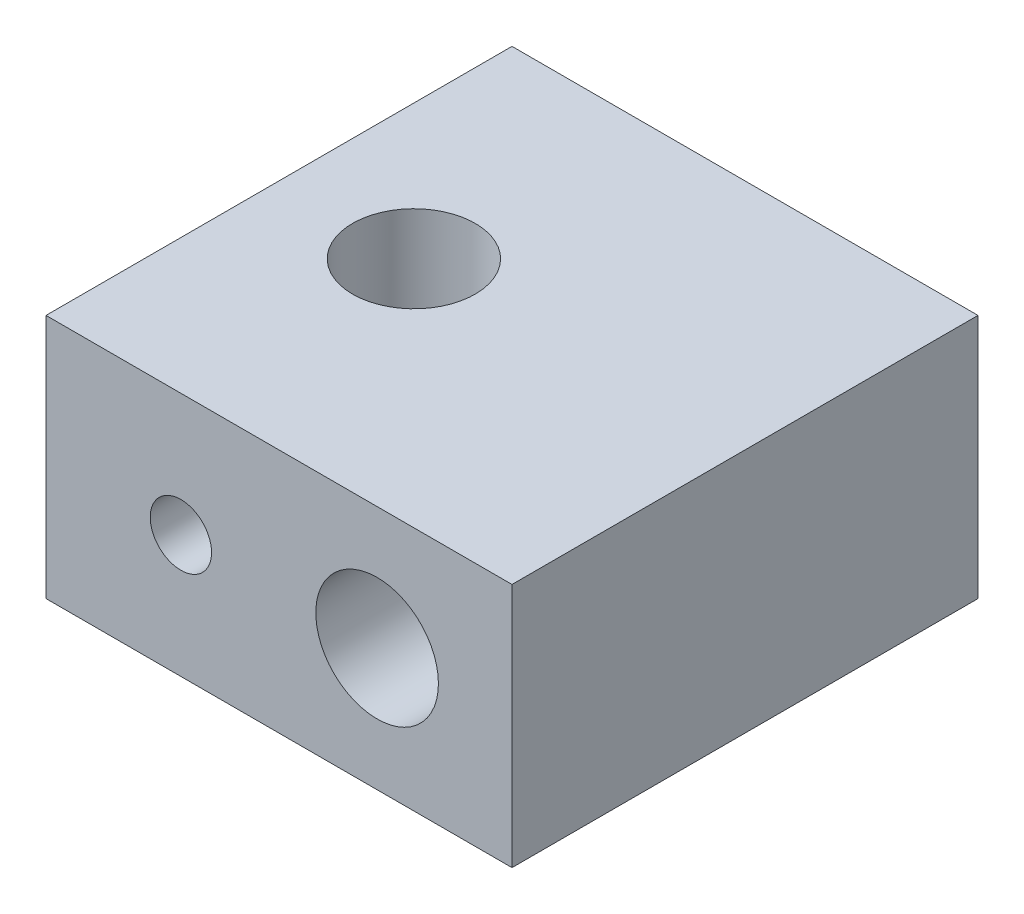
ISO-10303-21;
HEADER;
FILE_DESCRIPTION(('STEP AP214'),'2;1');
FILE_NAME('part.step','',(''),(''),'','','');
FILE_SCHEMA(('AUTOMOTIVE_DESIGN { 1 0 10303 214 1 1 1 1 }'));
ENDSEC;
DATA;
#1=APPLICATION_CONTEXT('core data for automotive mechanical design processes');
#2=APPLICATION_PROTOCOL_DEFINITION('international standard','automotive_design',2000,#1);
#3=PRODUCT_CONTEXT('',#1,'mechanical');
#4=PRODUCT('Part','Part','',(#3));
#5=PRODUCT_RELATED_PRODUCT_CATEGORY('part','',(#4));
#6=PRODUCT_DEFINITION_FORMATION('','',#4);
#7=PRODUCT_DEFINITION_CONTEXT('part definition',#1,'design');
#8=PRODUCT_DEFINITION('design','',#6,#7);
#9=PRODUCT_DEFINITION_SHAPE('','',#8);
#10=(LENGTH_UNIT() NAMED_UNIT(*) SI_UNIT(.MILLI.,.METRE.));
#11=(NAMED_UNIT(*) PLANE_ANGLE_UNIT() SI_UNIT($,.RADIAN.));
#12=(NAMED_UNIT(*) SI_UNIT($,.STERADIAN.) SOLID_ANGLE_UNIT());
#13=UNCERTAINTY_MEASURE_WITH_UNIT(LENGTH_MEASURE(1.E-05),#10,'distance_accuracy_value','');
#14=(GEOMETRIC_REPRESENTATION_CONTEXT(3) GLOBAL_UNCERTAINTY_ASSIGNED_CONTEXT((#13)) GLOBAL_UNIT_ASSIGNED_CONTEXT((#10,
#11,#12)) REPRESENTATION_CONTEXT('',''));
#15=CARTESIAN_POINT('',(0.,0.,0.));
#16=DIRECTION('',(0.,0.,1.));
#17=DIRECTION('',(1.,0.,0.));
#18=AXIS2_PLACEMENT_3D('',#15,#16,#17);
#19=CARTESIAN_POINT('',(-4.,0.,0.));
#20=DIRECTION('',(0.,1.,0.));
#21=DIRECTION('',(0.,0.,1.));
#22=AXIS2_PLACEMENT_3D('',#19,#20,#21);
#23=CYLINDRICAL_SURFACE('',#22,2.5);
#24=CARTESIAN_POINT('',(-4.,10.,0.));
#25=DIRECTION('',(0.,1.,0.));
#26=DIRECTION('',(0.,0.,1.));
#27=AXIS2_PLACEMENT_3D('',#24,#25,#26);
#28=CIRCLE('',#27,2.5);
#29=CARTESIAN_POINT('',(-4.,10.,2.5));
#30=VERTEX_POINT('',#29);
#31=EDGE_CURVE('E108',#30,#30,#28,.T.);
#32=ORIENTED_EDGE('',*,*,#31,.T.);
#33=EDGE_LOOP('',(#32));
#34=FACE_BOUND('',#33,.T.);
#35=CARTESIAN_POINT('',(-4.,1.5,0.));
#36=DIRECTION('',(0.,-1.,0.));
#37=DIRECTION('',(0.,0.,-1.));
#38=AXIS2_PLACEMENT_3D('',#35,#36,#37);
#39=CIRCLE('',#38,2.5);
#40=CARTESIAN_POINT('',(-4.,1.5,-2.5));
#41=VERTEX_POINT('',#40);
#42=EDGE_CURVE('E113',#41,#41,#39,.F.);
#43=ORIENTED_EDGE('',*,*,#42,.F.);
#44=EDGE_LOOP('',(#43));
#45=FACE_BOUND('',#44,.T.);
#46=ADVANCED_FACE('F34',(#34,#45),#23,.F.);
#47=CARTESIAN_POINT('',(-9.49999999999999,10.,9.50000000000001));
#48=DIRECTION('',(1.,0.,0.));
#49=DIRECTION('',(0.,0.,-1.));
#50=AXIS2_PLACEMENT_3D('',#47,#48,#49);
#51=PLANE('',#50);
#52=DIRECTION('',(0.,0.,1.));
#53=VECTOR('',#52,1.);
#54=CARTESIAN_POINT('',(-9.49999999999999,0.,9.50000000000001));
#55=LINE('',#54,#53);
#56=CARTESIAN_POINT('',(-9.49999999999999,0.,-9.49999999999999));
#57=VERTEX_POINT('',#56);
#58=CARTESIAN_POINT('',(-9.49999999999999,0.,9.50000000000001));
#59=VERTEX_POINT('',#58);
#60=EDGE_CURVE('E105',#57,#59,#55,.T.);
#61=ORIENTED_EDGE('',*,*,#60,.T.);
#62=DIRECTION('',(0.,-1.,0.));
#63=VECTOR('',#62,1.);
#64=CARTESIAN_POINT('',(-9.49999999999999,10.,9.50000000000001));
#65=LINE('',#64,#63);
#66=CARTESIAN_POINT('',(-9.49999999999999,10.,9.50000000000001));
#67=VERTEX_POINT('',#66);
#68=EDGE_CURVE('E11',#67,#59,#65,.T.);
#69=ORIENTED_EDGE('',*,*,#68,.F.);
#70=DIRECTION('',(0.,0.,1.));
#71=VECTOR('',#70,1.);
#72=CARTESIAN_POINT('',(-9.49999999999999,10.,9.50000000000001));
#73=LINE('',#72,#71);
#74=CARTESIAN_POINT('',(-9.49999999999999,10.,-9.49999999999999));
#75=VERTEX_POINT('',#74);
#76=EDGE_CURVE('E92',#75,#67,#73,.T.);
#77=ORIENTED_EDGE('',*,*,#76,.F.);
#78=DIRECTION('',(0.,-1.,0.));
#79=VECTOR('',#78,1.);
#80=CARTESIAN_POINT('',(-9.49999999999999,10.,-9.49999999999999));
#81=LINE('',#80,#79);
#82=EDGE_CURVE('E101',#75,#57,#81,.T.);
#83=ORIENTED_EDGE('',*,*,#82,.T.);
#84=EDGE_LOOP('',(#61,#69,#77,#83));
#85=FACE_BOUND('',#84,.T.);
#86=ADVANCED_FACE('F36',(#85),#51,.F.);
#87=CARTESIAN_POINT('',(9.50000000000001,10.,9.50000000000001));
#88=DIRECTION('',(0.,0.,-1.));
#89=DIRECTION('',(-1.,0.,0.));
#90=AXIS2_PLACEMENT_3D('',#87,#88,#89);
#91=PLANE('',#90);
#92=CARTESIAN_POINT('',(4.00000000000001,5.,9.50000000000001));
#93=DIRECTION('',(0.,0.,1.));
#94=DIRECTION('',(1.,0.,0.));
#95=AXIS2_PLACEMENT_3D('',#92,#93,#94);
#96=CIRCLE('',#95,2.5);
#97=CARTESIAN_POINT('',(6.50000000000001,5.,9.50000000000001));
#98=VERTEX_POINT('',#97);
#99=EDGE_CURVE('E115',#98,#98,#96,.T.);
#100=ORIENTED_EDGE('',*,*,#99,.F.);
#101=EDGE_LOOP('',(#100));
#102=FACE_BOUND('',#101,.T.);
#103=CARTESIAN_POINT('',(-3.99999999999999,5.,9.50000000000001));
#104=DIRECTION('',(0.,0.,1.));
#105=DIRECTION('',(1.,0.,0.));
#106=AXIS2_PLACEMENT_3D('',#103,#104,#105);
#107=CIRCLE('',#106,1.25);
#108=CARTESIAN_POINT('',(-2.74999999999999,5.,9.50000000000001));
#109=VERTEX_POINT('',#108);
#110=EDGE_CURVE('E133',#109,#109,#107,.T.);
#111=ORIENTED_EDGE('',*,*,#110,.F.);
#112=EDGE_LOOP('',(#111));
#113=FACE_BOUND('',#112,.T.);
#114=DIRECTION('',(1.,0.,0.));
#115=VECTOR('',#114,1.);
#116=CARTESIAN_POINT('',(9.50000000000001,0.,9.50000000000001));
#117=LINE('',#116,#115);
#118=CARTESIAN_POINT('',(9.50000000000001,0.,9.50000000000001));
#119=VERTEX_POINT('',#118);
#120=EDGE_CURVE('E96',#59,#119,#117,.T.);
#121=ORIENTED_EDGE('',*,*,#120,.T.);
#122=DIRECTION('',(0.,-1.,0.));
#123=VECTOR('',#122,1.);
#124=CARTESIAN_POINT('',(9.50000000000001,10.,9.50000000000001));
#125=LINE('',#124,#123);
#126=CARTESIAN_POINT('',(9.50000000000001,10.,9.50000000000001));
#127=VERTEX_POINT('',#126);
#128=EDGE_CURVE('E48',#127,#119,#125,.T.);
#129=ORIENTED_EDGE('',*,*,#128,.F.);
#130=DIRECTION('',(1.,0.,0.));
#131=VECTOR('',#130,1.);
#132=CARTESIAN_POINT('',(9.50000000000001,10.,9.50000000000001));
#133=LINE('',#132,#131);
#134=EDGE_CURVE('E87',#67,#127,#133,.T.);
#135=ORIENTED_EDGE('',*,*,#134,.F.);
#136=ORIENTED_EDGE('',*,*,#68,.T.);
#137=EDGE_LOOP('',(#121,#129,#135,#136));
#138=FACE_BOUND('',#137,.T.);
#139=ADVANCED_FACE('F95',(#102,#113,#138),#91,.F.);
#140=CARTESIAN_POINT('',(9.50000000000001,10.,9.50000000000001));
#141=DIRECTION('',(-1.,0.,0.));
#142=DIRECTION('',(0.,0.,1.));
#143=AXIS2_PLACEMENT_3D('',#140,#141,#142);
#144=PLANE('',#143);
#145=DIRECTION('',(0.,0.,-1.));
#146=VECTOR('',#145,1.);
#147=CARTESIAN_POINT('',(9.50000000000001,0.,9.50000000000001));
#148=LINE('',#147,#146);
#149=CARTESIAN_POINT('',(9.50000000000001,0.,-9.49999999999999));
#150=VERTEX_POINT('',#149);
#151=EDGE_CURVE('E74',#119,#150,#148,.T.);
#152=ORIENTED_EDGE('',*,*,#151,.T.);
#153=DIRECTION('',(0.,-1.,0.));
#154=VECTOR('',#153,1.);
#155=CARTESIAN_POINT('',(9.50000000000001,10.,-9.49999999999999));
#156=LINE('',#155,#154);
#157=CARTESIAN_POINT('',(9.50000000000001,10.,-9.49999999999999));
#158=VERTEX_POINT('',#157);
#159=EDGE_CURVE('E97',#158,#150,#156,.T.);
#160=ORIENTED_EDGE('',*,*,#159,.F.);
#161=DIRECTION('',(0.,0.,-1.));
#162=VECTOR('',#161,1.);
#163=CARTESIAN_POINT('',(9.50000000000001,10.,9.50000000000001));
#164=LINE('',#163,#162);
#165=EDGE_CURVE('E90',#127,#158,#164,.T.);
#166=ORIENTED_EDGE('',*,*,#165,.F.);
#167=ORIENTED_EDGE('',*,*,#128,.T.);
#168=EDGE_LOOP('',(#152,#160,#166,#167));
#169=FACE_BOUND('',#168,.T.);
#170=ADVANCED_FACE('F99',(#169),#144,.F.);
#171=CARTESIAN_POINT('',(9.50000000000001,10.,-9.49999999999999));
#172=DIRECTION('',(0.,0.,1.));
#173=DIRECTION('',(1.,0.,0.));
#174=AXIS2_PLACEMENT_3D('',#171,#172,#173);
#175=PLANE('',#174);
#176=CARTESIAN_POINT('',(4.00000000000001,5.,-9.49999999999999));
#177=DIRECTION('',(0.,0.,1.));
#178=DIRECTION('',(1.,0.,0.));
#179=AXIS2_PLACEMENT_3D('',#176,#177,#178);
#180=CIRCLE('',#179,2.5);
#181=CARTESIAN_POINT('',(6.50000000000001,5.,-9.49999999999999));
#182=VERTEX_POINT('',#181);
#183=EDGE_CURVE('E120',#182,#182,#180,.T.);
#184=ORIENTED_EDGE('',*,*,#183,.T.);
#185=EDGE_LOOP('',(#184));
#186=FACE_BOUND('',#185,.T.);
#187=DIRECTION('',(-1.,0.,0.));
#188=VECTOR('',#187,1.);
#189=CARTESIAN_POINT('',(9.50000000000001,0.,-9.49999999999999));
#190=LINE('',#189,#188);
#191=EDGE_CURVE('E80',#150,#57,#190,.T.);
#192=ORIENTED_EDGE('',*,*,#191,.T.);
#193=ORIENTED_EDGE('',*,*,#82,.F.);
#194=DIRECTION('',(-1.,0.,0.));
#195=VECTOR('',#194,1.);
#196=CARTESIAN_POINT('',(9.50000000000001,10.,-9.49999999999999));
#197=LINE('',#196,#195);
#198=EDGE_CURVE('E57',#158,#75,#197,.T.);
#199=ORIENTED_EDGE('',*,*,#198,.F.);
#200=ORIENTED_EDGE('',*,*,#159,.T.);
#201=EDGE_LOOP('',(#192,#193,#199,#200));
#202=FACE_BOUND('',#201,.T.);
#203=ADVANCED_FACE('F147',(#186,#202),#175,.F.);
#204=CARTESIAN_POINT('',(0.,10.,0.));
#205=DIRECTION('',(0.,1.,0.));
#206=DIRECTION('',(0.,0.,1.));
#207=AXIS2_PLACEMENT_3D('',#204,#205,#206);
#208=PLANE('',#207);
#209=ORIENTED_EDGE('',*,*,#31,.F.);
#210=EDGE_LOOP('',(#209));
#211=FACE_BOUND('',#210,.T.);
#212=ORIENTED_EDGE('',*,*,#76,.T.);
#213=ORIENTED_EDGE('',*,*,#134,.T.);
#214=ORIENTED_EDGE('',*,*,#165,.T.);
#215=ORIENTED_EDGE('',*,*,#198,.T.);
#216=EDGE_LOOP('',(#212,#213,#214,#215));
#217=FACE_BOUND('',#216,.T.);
#218=ADVANCED_FACE('F88',(#211,#217),#208,.T.);
#219=CARTESIAN_POINT('',(0.,0.,0.));
#220=DIRECTION('',(0.,1.,0.));
#221=DIRECTION('',(0.,0.,1.));
#222=AXIS2_PLACEMENT_3D('',#219,#220,#221);
#223=PLANE('',#222);
#224=CARTESIAN_POINT('',(4.00000000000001,0.,0.));
#225=DIRECTION('',(0.,-1.,0.));
#226=DIRECTION('',(0.,0.,-1.));
#227=AXIS2_PLACEMENT_3D('',#224,#225,#226);
#228=CIRCLE('',#227,1.25);
#229=CARTESIAN_POINT('',(4.00000000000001,0.,-1.25));
#230=VERTEX_POINT('',#229);
#231=EDGE_CURVE('E130',#230,#230,#228,.T.);
#232=ORIENTED_EDGE('',*,*,#231,.F.);
#233=EDGE_LOOP('',(#232));
#234=FACE_BOUND('',#233,.T.);
#235=CARTESIAN_POINT('',(-3.99999999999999,0.,0.));
#236=DIRECTION('',(0.,-1.,0.));
#237=DIRECTION('',(0.,0.,-1.));
#238=AXIS2_PLACEMENT_3D('',#235,#236,#237);
#239=CIRCLE('',#238,3.25);
#240=CARTESIAN_POINT('',(-3.99999999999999,0.,-3.25));
#241=VERTEX_POINT('',#240);
#242=EDGE_CURVE('E123',#241,#241,#239,.T.);
#243=ORIENTED_EDGE('',*,*,#242,.F.);
#244=EDGE_LOOP('',(#243));
#245=FACE_BOUND('',#244,.T.);
#246=ORIENTED_EDGE('',*,*,#60,.F.);
#247=ORIENTED_EDGE('',*,*,#191,.F.);
#248=ORIENTED_EDGE('',*,*,#151,.F.);
#249=ORIENTED_EDGE('',*,*,#120,.F.);
#250=EDGE_LOOP('',(#246,#247,#248,#249));
#251=FACE_BOUND('',#250,.T.);
#252=ADVANCED_FACE('F146',(#234,#245,#251),#223,.F.);
#253=CARTESIAN_POINT('',(-3.99999999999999,5.,4.50000000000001));
#254=DIRECTION('',(0.,0.,1.));
#255=DIRECTION('',(1.,0.,0.));
#256=AXIS2_PLACEMENT_3D('',#253,#254,#255);
#257=CYLINDRICAL_SURFACE('',#256,1.25);
#258=CARTESIAN_POINT('',(-3.99999999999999,5.,4.50000000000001));
#259=DIRECTION('',(0.,0.,1.));
#260=DIRECTION('',(1.,0.,0.));
#261=AXIS2_PLACEMENT_3D('',#258,#259,#260);
#262=CIRCLE('',#261,1.25);
#263=CARTESIAN_POINT('',(-2.74999999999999,5.,4.50000000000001));
#264=VERTEX_POINT('',#263);
#265=EDGE_CURVE('E135',#264,#264,#262,.T.);
#266=ORIENTED_EDGE('',*,*,#265,.F.);
#267=EDGE_LOOP('',(#266));
#268=FACE_BOUND('',#267,.T.);
#269=ORIENTED_EDGE('',*,*,#110,.T.);
#270=EDGE_LOOP('',(#269));
#271=FACE_BOUND('',#270,.T.);
#272=ADVANCED_FACE('F153',(#268,#271),#257,.F.);
#273=CARTESIAN_POINT('',(-3.99999999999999,5.,4.50000000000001));
#274=DIRECTION('',(0.,0.,1.));
#275=DIRECTION('',(1.,0.,0.));
#276=AXIS2_PLACEMENT_3D('',#273,#274,#275);
#277=PLANE('',#276);
#278=ORIENTED_EDGE('',*,*,#265,.T.);
#279=EDGE_LOOP('',(#278));
#280=FACE_BOUND('',#279,.T.);
#281=ADVANCED_FACE('F167',(#280),#277,.T.);
#282=CARTESIAN_POINT('',(4.00000000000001,5.,-9.49999999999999));
#283=DIRECTION('',(0.,0.,1.));
#284=DIRECTION('',(1.,0.,0.));
#285=AXIS2_PLACEMENT_3D('',#282,#283,#284);
#286=CYLINDRICAL_SURFACE('',#285,2.5);
#287=CARTESIAN_POINT('',(4.00000000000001,2.5,-1.25));
#288=CARTESIAN_POINT('',(4.06571495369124,2.50000358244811,-1.24999587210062));
#289=CARTESIAN_POINT('',(4.13150824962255,2.50261886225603,-1.24478740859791));
#290=CARTESIAN_POINT('',(4.26115029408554,2.51282304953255,-1.22418389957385));
#291=CARTESIAN_POINT('',(4.32499510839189,2.52042140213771,-1.20876950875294));
#292=CARTESIAN_POINT('',(4.44866693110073,2.5397965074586,-1.16850773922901));
#293=CARTESIAN_POINT('',(4.50850850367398,2.551557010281,-1.14369701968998));
#294=CARTESIAN_POINT('',(4.62309077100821,2.57817779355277,-1.08553672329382));
#295=CARTESIAN_POINT('',(4.67783186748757,2.59303782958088,-1.05218781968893));
#296=CARTESIAN_POINT('',(4.78438477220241,2.62554677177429,-0.975603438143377));
#297=CARTESIAN_POINT('',(4.83581901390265,2.6433100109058,-0.931891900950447));
#298=CARTESIAN_POINT('',(4.93097430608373,2.6792503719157,-0.836848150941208));
#299=CARTESIAN_POINT('',(4.97468947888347,2.69742779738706,-0.785510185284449));
#300=CARTESIAN_POINT('',(5.05656500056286,2.73376311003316,-0.671895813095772));
#301=CARTESIAN_POINT('',(5.09403166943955,2.75181016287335,-0.609079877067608));
#302=CARTESIAN_POINT('',(5.15771028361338,2.78392526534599,-0.477040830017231));
#303=CARTESIAN_POINT('',(5.18393026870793,2.79799615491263,-0.407822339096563));
#304=CARTESIAN_POINT('',(5.22266555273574,2.81927666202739,-0.269168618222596));
#305=CARTESIAN_POINT('',(5.23590732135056,2.82684660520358,-0.199994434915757));
#306=CARTESIAN_POINT('',(5.25053374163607,2.8352263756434,-0.0600264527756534));
#307=CARTESIAN_POINT('',(5.25193011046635,2.8360428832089,0.0107656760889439));
#308=CARTESIAN_POINT('',(5.24335910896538,2.83111337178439,0.142857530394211));
#309=CARTESIAN_POINT('',(5.23473069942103,2.82614045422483,0.204280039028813));
#310=CARTESIAN_POINT('',(5.20867481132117,2.81154714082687,0.324652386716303));
#311=CARTESIAN_POINT('',(5.19124452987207,2.8019252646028,0.383601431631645));
#312=CARTESIAN_POINT('',(5.14776222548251,2.77890654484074,0.499036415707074));
#313=CARTESIAN_POINT('',(5.121518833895,2.76542699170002,0.555432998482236));
#314=CARTESIAN_POINT('',(5.06130210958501,2.73620744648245,0.66329286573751));
#315=CARTESIAN_POINT('',(5.02732530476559,2.72046644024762,0.714753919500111));
#316=CARTESIAN_POINT('',(4.94758256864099,2.68608552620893,0.818151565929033));
#317=CARTESIAN_POINT('',(4.90086807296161,2.66733112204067,0.869321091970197));
#318=CARTESIAN_POINT('',(4.79944447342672,2.63065470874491,0.963419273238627));
#319=CARTESIAN_POINT('',(4.74473157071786,2.61273310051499,1.00634399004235));
#320=CARTESIAN_POINT('',(4.62564563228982,2.57872515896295,1.08460707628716));
#321=CARTESIAN_POINT('',(4.56094198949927,2.56276269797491,1.11950059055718));
#322=CARTESIAN_POINT('',(4.425582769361,2.53552648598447,1.17762128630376));
#323=CARTESIAN_POINT('',(4.3549319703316,2.52424901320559,1.20085773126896));
#324=CARTESIAN_POINT('',(4.21595811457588,2.50844582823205,1.23309425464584));
#325=CARTESIAN_POINT('',(4.14792691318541,2.5034382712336,1.24311404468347));
#326=CARTESIAN_POINT('',(4.0109744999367,2.49908733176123,1.25183091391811));
#327=CARTESIAN_POINT('',(3.94205372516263,2.4997412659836,1.25053335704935));
#328=CARTESIAN_POINT('',(3.81095878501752,2.50636009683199,1.23724163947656));
#329=CARTESIAN_POINT('',(3.74867573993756,2.51190942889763,1.22608433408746));
#330=CARTESIAN_POINT('',(3.62699138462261,2.52722285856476,1.19470241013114));
#331=CARTESIAN_POINT('',(3.56759039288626,2.53698742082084,1.1744767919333));
#332=CARTESIAN_POINT('',(3.45138923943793,2.56019685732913,1.12500191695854));
#333=CARTESIAN_POINT('',(3.39471200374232,2.57373897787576,1.09551118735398));
#334=CARTESIAN_POINT('',(3.28692329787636,2.60320032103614,1.02861558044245));
#335=CARTESIAN_POINT('',(3.23581421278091,2.61912055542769,0.991207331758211));
#336=CARTESIAN_POINT('',(3.13529038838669,2.65364723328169,0.905299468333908));
#337=CARTESIAN_POINT('',(3.08653490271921,2.67236393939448,0.856071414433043));
#338=CARTESIAN_POINT('',(2.99767959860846,2.70922010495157,0.75009356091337));
#339=CARTESIAN_POINT('',(2.95758576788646,2.72735915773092,0.693338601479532));
#340=CARTESIAN_POINT('',(2.88536510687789,2.76186009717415,0.57044543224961));
#341=CARTESIAN_POINT('',(2.85371813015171,2.7780933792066,0.503985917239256));
#342=CARTESIAN_POINT('',(2.80239646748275,2.80532409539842,0.365612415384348));
#343=CARTESIAN_POINT('',(2.78270635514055,2.81632827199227,0.293705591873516));
#344=CARTESIAN_POINT('',(2.75767289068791,2.83048123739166,0.15386222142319));
#345=CARTESIAN_POINT('',(2.75113375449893,2.83428270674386,0.086207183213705));
#346=CARTESIAN_POINT('',(2.74913855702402,2.83543306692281,-0.0493088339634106));
#347=CARTESIAN_POINT('',(2.75367769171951,2.83278475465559,-0.117169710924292));
#348=CARTESIAN_POINT('',(2.77259234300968,2.82202672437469,-0.244354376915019));
#349=CARTESIAN_POINT('',(2.78598960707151,2.81446131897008,-0.3038755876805));
#350=CARTESIAN_POINT('',(2.8210308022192,2.79536229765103,-0.419760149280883));
#351=CARTESIAN_POINT('',(2.84267738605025,2.78382740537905,-0.476122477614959));
#352=CARTESIAN_POINT('',(2.89523031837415,2.7571433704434,-0.588281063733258));
#353=CARTESIAN_POINT('',(2.92666107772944,2.74180347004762,-0.643784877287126));
#354=CARTESIAN_POINT('',(2.99731128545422,2.70955835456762,-0.749093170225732));
#355=CARTESIAN_POINT('',(3.0365347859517,2.69265232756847,-0.798894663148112));
#356=CARTESIAN_POINT('',(3.12724584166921,2.65672096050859,-0.89767747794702));
#357=CARTESIAN_POINT('',(3.17964447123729,2.63768770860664,-0.945823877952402));
#358=CARTESIAN_POINT('',(3.29230649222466,2.6015280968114,-1.03282872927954));
#359=CARTESIAN_POINT('',(3.35257409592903,2.5844027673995,-1.07168217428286));
#360=CARTESIAN_POINT('',(3.48008550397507,2.55377488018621,-1.13904545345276));
#361=CARTESIAN_POINT('',(3.54737562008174,2.54029879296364,-1.16748021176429));
#362=CARTESIAN_POINT('',(3.68657237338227,2.51873323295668,-1.21226020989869));
#363=CARTESIAN_POINT('',(3.75846525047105,2.51062845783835,-1.22863980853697));
#364=CARTESIAN_POINT('',(3.85924756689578,2.50380672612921,-1.24237176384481));
#365=CARTESIAN_POINT('',(3.88729765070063,2.50238293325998,-1.24522830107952));
#366=CARTESIAN_POINT('',(3.94356033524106,2.50047878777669,-1.24904333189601));
#367=CARTESIAN_POINT('',(3.97177294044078,2.49999846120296,-1.250001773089));
#368=CARTESIAN_POINT('',(4.00000000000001,2.5,-1.25));
#369=B_SPLINE_CURVE_WITH_KNOTS('',3,(#287,#288,#289,#290,#291,#292,#293,#294,#295,#296,#297,
#298,#299,#300,#301,#302,#303,#304,#305,#306,#307,#308,#309,#310,#311,#312,#313,#314,#315,#316,
#317,#318,#319,#320,#321,#322,#323,#324,#325,#326,#327,#328,#329,#330,#331,#332,#333,#334,#335,
#336,#337,#338,#339,#340,#341,#342,#343,#344,#345,#346,#347,#348,#349,#350,#351,#352,#353,#354,
#355,#356,#357,#358,#359,#360,#361,#362,#363,#364,#365,#366,#367,#368),.UNSPECIFIED.,.T.,.F.,(4,
2,2,2,2,2,2,2,2,2,2,2,2,2,2,2,2,2,2,2,2,2,2,2,2,2,2,2,2,2,2,2,2,2,2,2,2,2,2,2,4),(0.,
0.197030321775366,0.394435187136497,0.591077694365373,0.78770470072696,0.996227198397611,
1.20490779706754,1.42977158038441,1.65447434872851,1.86572515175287,2.07676696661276,
2.26257140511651,2.44843504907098,2.63862800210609,2.82890651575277,3.04331176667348,
3.25781918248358,3.48228777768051,3.7065777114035,3.91229113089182,4.11790705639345,
4.30758633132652,4.49728652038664,4.69241070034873,4.88761813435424,5.10199513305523,
5.3165198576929,5.54143352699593,5.76605639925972,5.96911634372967,6.17208824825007,
6.35572412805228,6.53941910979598,6.73545570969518,6.93159451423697,7.15156553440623,
7.37165479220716,7.59330017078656,7.81431135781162,7.89894100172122,7.98357298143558),.UNSPECIFIED.);
#370=CARTESIAN_POINT('',(4.00000000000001,2.5,-1.25));
#371=VERTEX_POINT('',#370);
#372=EDGE_CURVE('E38',#371,#371,#369,.T.);
#373=ORIENTED_EDGE('',*,*,#372,.T.);
#374=EDGE_LOOP('',(#373));
#375=FACE_BOUND('',#374,.T.);
#376=ORIENTED_EDGE('',*,*,#183,.F.);
#377=EDGE_LOOP('',(#376));
#378=FACE_BOUND('',#377,.T.);
#379=ORIENTED_EDGE('',*,*,#99,.T.);
#380=EDGE_LOOP('',(#379));
#381=FACE_BOUND('',#380,.T.);
#382=ADVANCED_FACE('F170',(#375,#378,#381),#286,.F.);
#383=CARTESIAN_POINT('',(-3.99999999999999,1.5,0.));
#384=DIRECTION('',(0.,-1.,0.));
#385=DIRECTION('',(0.,0.,-1.));
#386=AXIS2_PLACEMENT_3D('',#383,#384,#385);
#387=PLANE('',#386);
#388=CARTESIAN_POINT('',(-3.99999999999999,1.5,0.));
#389=DIRECTION('',(0.,-1.,0.));
#390=DIRECTION('',(0.,0.,-1.));
#391=AXIS2_PLACEMENT_3D('',#388,#389,#390);
#392=CIRCLE('',#391,3.25);
#393=CARTESIAN_POINT('',(-3.99999999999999,1.5,-3.25));
#394=VERTEX_POINT('',#393);
#395=EDGE_CURVE('E116',#394,#394,#392,.T.);
#396=ORIENTED_EDGE('',*,*,#395,.T.);
#397=EDGE_LOOP('',(#396));
#398=FACE_BOUND('',#397,.T.);
#399=ORIENTED_EDGE('',*,*,#42,.T.);
#400=EDGE_LOOP('',(#399));
#401=FACE_BOUND('',#400,.T.);
#402=ADVANCED_FACE('F175',(#398,#401),#387,.T.);
#403=CARTESIAN_POINT('',(-3.99999999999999,1.5,0.));
#404=DIRECTION('',(0.,-1.,0.));
#405=DIRECTION('',(0.,0.,-1.));
#406=AXIS2_PLACEMENT_3D('',#403,#404,#405);
#407=CYLINDRICAL_SURFACE('',#406,3.25);
#408=ORIENTED_EDGE('',*,*,#395,.F.);
#409=EDGE_LOOP('',(#408));
#410=FACE_BOUND('',#409,.T.);
#411=ORIENTED_EDGE('',*,*,#242,.T.);
#412=EDGE_LOOP('',(#411));
#413=FACE_BOUND('',#412,.T.);
#414=ADVANCED_FACE('F177',(#410,#413),#407,.F.);
#415=CARTESIAN_POINT('',(4.00000000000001,5.,0.));
#416=DIRECTION('',(0.,-1.,0.));
#417=DIRECTION('',(0.,0.,-1.));
#418=AXIS2_PLACEMENT_3D('',#415,#416,#417);
#419=CYLINDRICAL_SURFACE('',#418,1.25);
#420=ORIENTED_EDGE('',*,*,#231,.T.);
#421=EDGE_LOOP('',(#420));
#422=FACE_BOUND('',#421,.T.);
#423=ORIENTED_EDGE('',*,*,#372,.F.);
#424=EDGE_LOOP('',(#423));
#425=FACE_BOUND('',#424,.T.);
#426=ADVANCED_FACE('F180',(#422,#425),#419,.F.);
#427=CLOSED_SHELL('',(#46,#86,#139,#170,#203,#218,#252,#272,#281,#382,#402,#414,#426));
#428=MANIFOLD_SOLID_BREP('B2',#427);
#429=ADVANCED_BREP_SHAPE_REPRESENTATION('',(#18,#428),#14);
#430=SHAPE_DEFINITION_REPRESENTATION(#9,#429);
ENDSEC;
END-ISO-10303-21;
